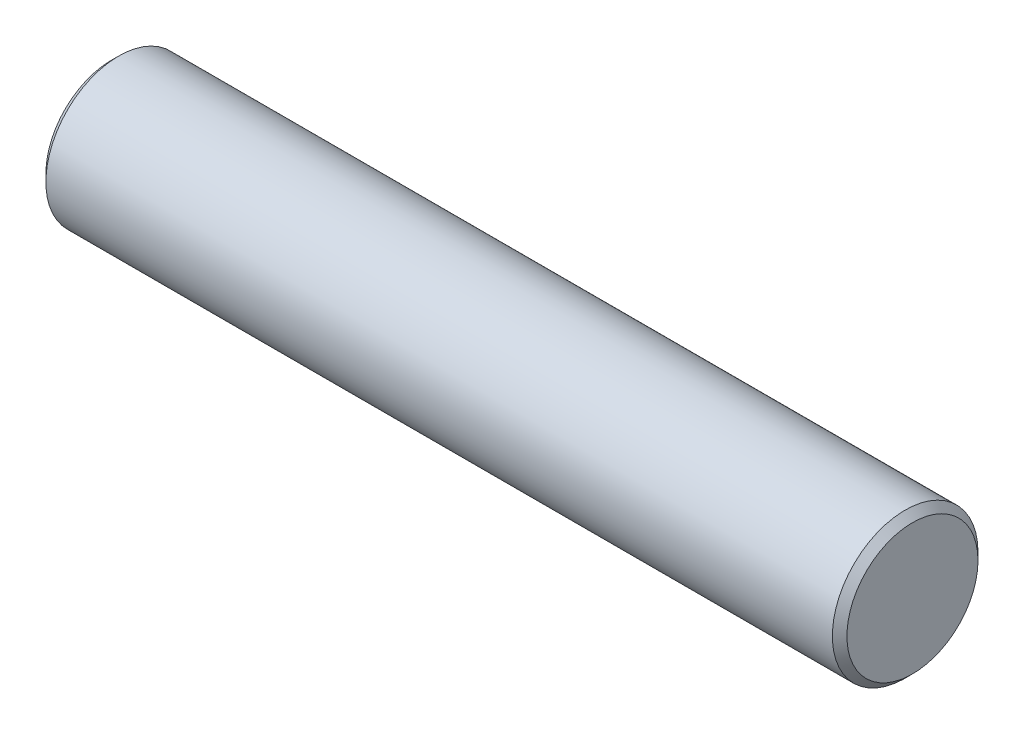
from build123d import *

# Parameters (mm, degrees)
SKETCH_1_R      = 5
EXTRUDE_1_DEPTH = 27.5
CHAMFER_1_SIZE  = 0.5


with BuildPart() as part:
    # Sketch 1 → Extrude 1 (new, symmetric)
    with BuildSketch(Plane(origin=(0, 0, 0), x_dir=(0, 0, -1), z_dir=(1, 0, 0))):
        Circle(SKETCH_1_R)
    extrude(amount=EXTRUDE_1_DEPTH, both=True)

    # Chamfer 1
    chamfer_1_edges = [part.edges().sort_by_distance(p)[0] for p in [
        (-27.5, 0, 5),
        (27.5, 0, 5),
    ]]
    chamfer(chamfer_1_edges, length=CHAMFER_1_SIZE)


solid = part.part
